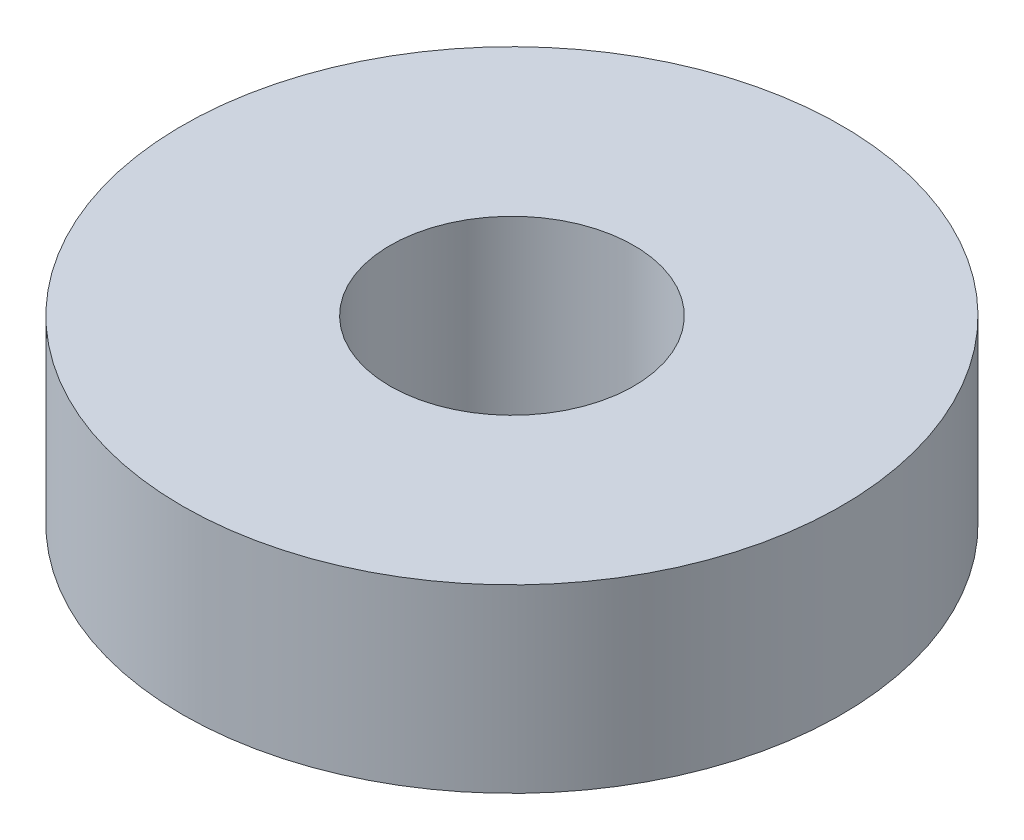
from build123d import *

# Parameters (mm, degrees)
SKETCH1_R           = 9.271
SKETCH1_R_2         = 3.429
BOSS_EXTRUDE1_DEPTH = 5.08


with BuildPart() as part:
    # Sketch1 → Boss-Extrude1 (new body)
    with BuildSketch(Plane(origin=(0, 0, 0), x_dir=(1, 0, 0), z_dir=(0, 1, 0))):
        with Locations(Location((0, 0, 0), (0, 0, 270))):
            Circle(SKETCH1_R)
        with Locations(Location((0, 0, 0), (0, 0, 270))):
            Circle(SKETCH1_R_2, mode=Mode.SUBTRACT)
    extrude(amount=BOSS_EXTRUDE1_DEPTH)


solid = part.part
